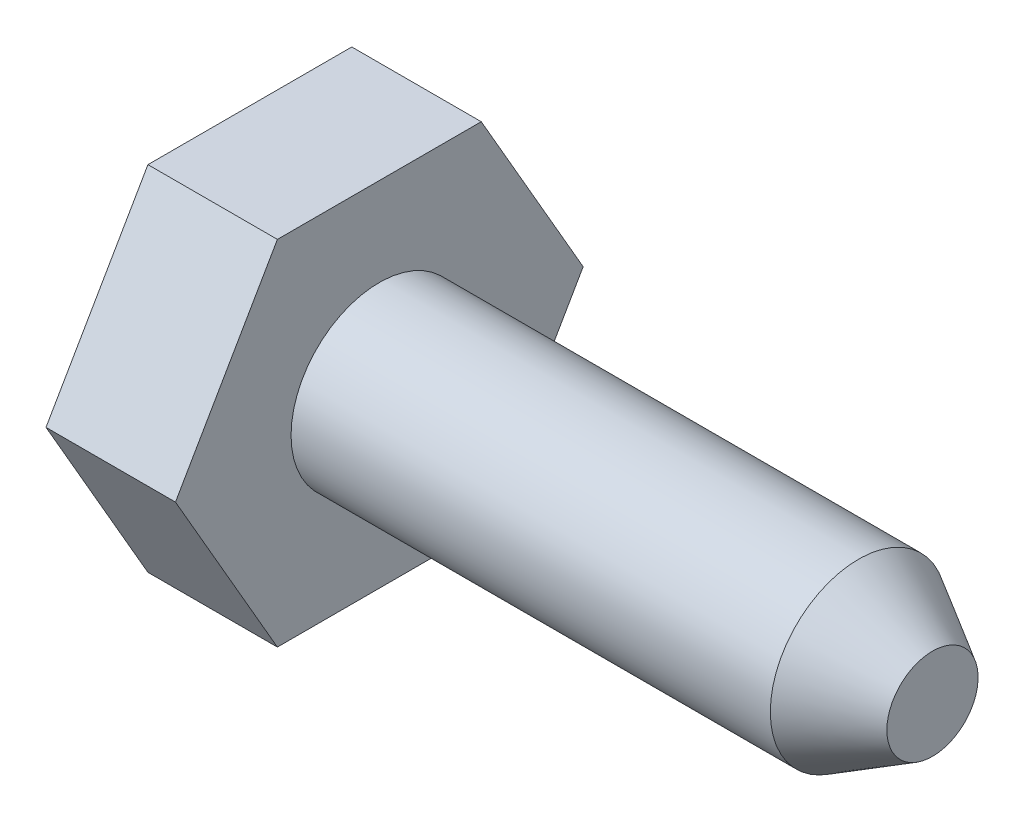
from build123d import *

# Parameters (mm, degrees)
EXTRUDE1_DEPTH = 1.1176


with BuildPart() as part:
    # Sketch1 → base-Revolve (revolve)
    with BuildSketch(Plane.XY, mode=Mode.PRIVATE) as base_revolve_sk:
        Polygon((0, 0.762), (0, 1.524), (-1.1176, 1.524), (-1.1176, 1.2192), (-0.89408, 1.2192), (-0.89408, 0), (0, 0), (4.7752, 0), (4.7752, 0.762), align=None)
    revolve(base_revolve_sk.sketch.rotate(Axis((0, 0, 0), (1, 0, 0)), 90), axis=Axis((0, 0, 0), (1, 0, 0)))

    # Sketch15 → Extrude1 (add)
    with BuildSketch(Plane.ZY.offset(1.1176)):
        with BuildLine():
            ThreePointArc((-1.319822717, -0.761999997), (-1.524, 6e-09), (-1.319822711, 0.762000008))
            Line((-1.319822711, 0.762000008), (-1.75976362, 0))
            Line((-1.75976362, 0), (-1.319822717, -0.761999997))
        make_face()
        with BuildLine():
            ThreePointArc((-1.319822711, 0.762000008), (-0.761999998, 1.319822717), (-5e-09, 1.524))
            Line((-5e-09, 1.524), (-0.87988181, 1.524))
            Line((-0.87988181, 1.524), (-1.319822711, 0.762000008))
        make_face()
        with BuildLine():
            ThreePointArc((-5e-09, 1.524), (0.761999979, 1.319822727), (1.319822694, 0.762000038))
            Line((1.319822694, 0.762000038), (0.87988181, 1.524))
            Line((0.87988181, 1.524), (-5e-09, 1.524))
        make_face()
        with BuildLine():
            Line((1.319822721, -0.76199999), (1.75976362, 0))
            Line((1.75976362, 0), (1.319822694, 0.762000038))
            ThreePointArc((1.319822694, 0.762000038), (1.472070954, 0.394440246), (1.524, 0))
            ThreePointArc((1.524, 0), (1.472070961, -0.394440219), (1.319822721, -0.76199999))
        make_face()
        with BuildLine():
            Line((0.87988181, -1.524), (1.319822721, -0.76199999))
            ThreePointArc((1.319822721, -0.76199999), (0.762000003, -1.319822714), (-5e-09, -1.524))
            Line((-5e-09, -1.524), (0.87988181, -1.524))
        make_face()
        with BuildLine():
            Line((-0.87988181, -1.524), (-5e-09, -1.524))
            ThreePointArc((-5e-09, -1.524), (-0.762000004, -1.319822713), (-1.319822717, -0.761999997))
            Line((-1.319822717, -0.761999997), (-0.87988181, -1.524))
        make_face()
    extrude(amount=-EXTRUDE1_DEPTH)

    # Sketch8 → point_Cut-Revolve1 (revolve, cut)
    with BuildSketch(Plane.XY, mode=Mode.PRIVATE) as point_cut_revolve1_sk:
        Polygon((4.7752, 0), (5.2832, 0), (5.2832, 1.27), (4.137285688, 1.27), (4.137285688, 0.762), (4.7752, 0.3937), align=None)
    revolve(point_cut_revolve1_sk.sketch.rotate(Axis((0, 0, 0), (1, 0, 0)), 90), axis=Axis((0, 0, 0), (1, 0, 0)), mode=Mode.SUBTRACT)


solid = part.part
